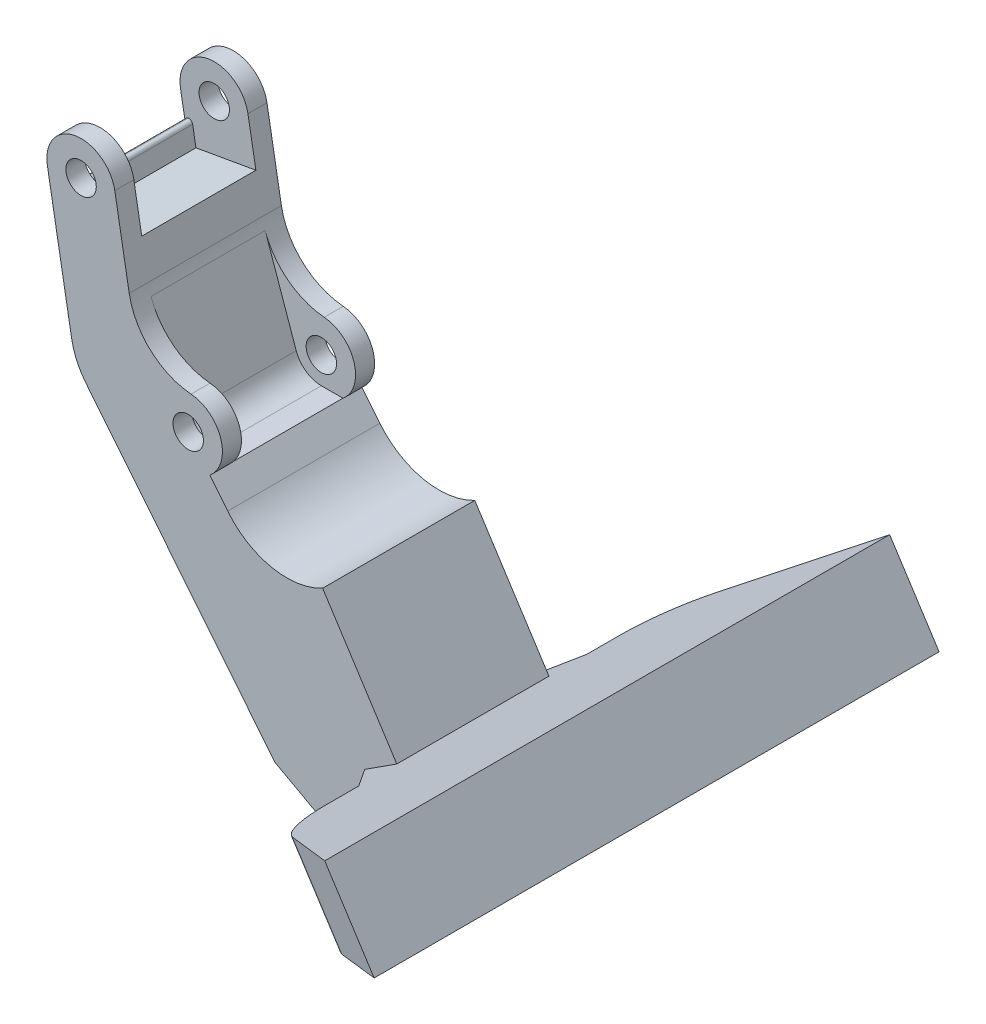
ISO-10303-21;
HEADER;
FILE_DESCRIPTION(('STEP AP214'),'2;1');
FILE_NAME('part.step','',(''),(''),'','','');
FILE_SCHEMA(('AUTOMOTIVE_DESIGN { 1 0 10303 214 1 1 1 1 }'));
ENDSEC;
DATA;
#1=APPLICATION_CONTEXT('core data for automotive mechanical design processes');
#2=APPLICATION_PROTOCOL_DEFINITION('international standard','automotive_design',2000,#1);
#3=PRODUCT_CONTEXT('',#1,'mechanical');
#4=PRODUCT('Part','Part','',(#3));
#5=PRODUCT_RELATED_PRODUCT_CATEGORY('part','',(#4));
#6=PRODUCT_DEFINITION_FORMATION('','',#4);
#7=PRODUCT_DEFINITION_CONTEXT('part definition',#1,'design');
#8=PRODUCT_DEFINITION('design','',#6,#7);
#9=PRODUCT_DEFINITION_SHAPE('','',#8);
#10=(LENGTH_UNIT() NAMED_UNIT(*) SI_UNIT(.MILLI.,.METRE.));
#11=(NAMED_UNIT(*) PLANE_ANGLE_UNIT() SI_UNIT($,.RADIAN.));
#12=(NAMED_UNIT(*) SI_UNIT($,.STERADIAN.) SOLID_ANGLE_UNIT());
#13=UNCERTAINTY_MEASURE_WITH_UNIT(LENGTH_MEASURE(1.E-05),#10,'distance_accuracy_value','');
#14=(GEOMETRIC_REPRESENTATION_CONTEXT(3) GLOBAL_UNCERTAINTY_ASSIGNED_CONTEXT((#13)) GLOBAL_UNIT_ASSIGNED_CONTEXT((#10,
#11,#12)) REPRESENTATION_CONTEXT('',''));
#15=CARTESIAN_POINT('',(0.,0.,0.));
#16=DIRECTION('',(0.,0.,1.));
#17=DIRECTION('',(1.,0.,0.));
#18=AXIS2_PLACEMENT_3D('',#15,#16,#17);
#19=CARTESIAN_POINT('',(-0.078322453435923,26.3586558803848,10.));
#20=DIRECTION('',(0.,0.,-1.));
#21=DIRECTION('',(-1.,0.,0.));
#22=AXIS2_PLACEMENT_3D('',#19,#20,#21);
#23=CYLINDRICAL_SURFACE('',#22,4.5);
#24=DIRECTION('',(0.,0.,-1.));
#25=VECTOR('',#24,1.);
#26=CARTESIAN_POINT('',(-4.50995734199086,25.5772390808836,10.));
#27=LINE('',#26,#25);
#28=CARTESIAN_POINT('',(-4.50995734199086,25.5772390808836,-7.5));
#29=VERTEX_POINT('',#28);
#30=CARTESIAN_POINT('',(-4.50995734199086,25.5772390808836,-10.));
#31=VERTEX_POINT('',#30);
#32=EDGE_CURVE('E284',#29,#31,#27,.T.);
#33=ORIENTED_EDGE('',*,*,#32,.F.);
#34=CARTESIAN_POINT('',(-0.078322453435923,26.3586558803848,-7.5));
#35=DIRECTION('',(0.,0.,1.));
#36=DIRECTION('',(1.,0.,0.));
#37=AXIS2_PLACEMENT_3D('',#34,#35,#36);
#38=CIRCLE('',#37,4.5);
#39=CARTESIAN_POINT('',(4.35331243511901,27.140072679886,-7.5));
#40=VERTEX_POINT('',#39);
#41=EDGE_CURVE('E391',#40,#29,#38,.T.);
#42=ORIENTED_EDGE('',*,*,#41,.F.);
#43=DIRECTION('',(0.,0.,-1.));
#44=VECTOR('',#43,1.);
#45=CARTESIAN_POINT('',(4.35331243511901,27.140072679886,10.));
#46=LINE('',#45,#44);
#47=CARTESIAN_POINT('',(4.35331243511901,27.140072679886,-10.));
#48=VERTEX_POINT('',#47);
#49=EDGE_CURVE('E283',#40,#48,#46,.T.);
#50=ORIENTED_EDGE('',*,*,#49,.T.);
#51=CARTESIAN_POINT('',(-0.078322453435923,26.3586558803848,-10.));
#52=DIRECTION('',(0.,0.,1.));
#53=DIRECTION('',(1.,0.,0.));
#54=AXIS2_PLACEMENT_3D('',#51,#52,#53);
#55=CIRCLE('',#54,4.5);
#56=EDGE_CURVE('E289',#48,#31,#55,.T.);
#57=ORIENTED_EDGE('',*,*,#56,.T.);
#58=EDGE_LOOP('',(#33,#42,#50,#57));
#59=FACE_BOUND('',#58,.T.);
#60=ADVANCED_FACE('F34',(#59),#23,.T.);
#61=CARTESIAN_POINT('',(20.3509788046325,13.1072854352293,-10.));
#62=DIRECTION('',(-0.840717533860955,-0.541473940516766,0.));
#63=DIRECTION('',(0.541473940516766,-0.840717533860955,0.));
#64=AXIS2_PLACEMENT_3D('',#61,#62,#63);
#65=PLANE('',#64);
#66=DIRECTION('',(0.,0.,1.));
#67=VECTOR('',#66,1.);
#68=CARTESIAN_POINT('',(41.4121930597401,-19.5933318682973,-25.));
#69=LINE('',#68,#67);
#70=CARTESIAN_POINT('',(41.4121930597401,-19.5933318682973,-10.));
#71=VERTEX_POINT('',#70);
#72=CARTESIAN_POINT('',(41.4121930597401,-19.5933318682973,10.));
#73=VERTEX_POINT('',#72);
#74=EDGE_CURVE('E311',#71,#73,#69,.T.);
#75=ORIENTED_EDGE('',*,*,#74,.F.);
#76=DIRECTION('',(0.541473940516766,-0.840717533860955,0.));
#77=VECTOR('',#76,1.);
#78=CARTESIAN_POINT('',(20.3509788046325,13.1072854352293,-10.));
#79=LINE('',#78,#77);
#80=CARTESIAN_POINT('',(31.6656621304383,-4.46041625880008,-10.));
#81=VERTEX_POINT('',#80);
#82=EDGE_CURVE('E529',#81,#71,#79,.T.);
#83=ORIENTED_EDGE('',*,*,#82,.F.);
#84=DIRECTION('',(0.,0.,1.));
#85=VECTOR('',#84,1.);
#86=CARTESIAN_POINT('',(31.6656621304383,-4.46041625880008,-10.));
#87=LINE('',#86,#85);
#88=CARTESIAN_POINT('',(31.6656621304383,-4.46041625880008,10.));
#89=VERTEX_POINT('',#88);
#90=EDGE_CURVE('E523',#81,#89,#87,.T.);
#91=ORIENTED_EDGE('',*,*,#90,.T.);
#92=DIRECTION('',(0.541473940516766,-0.840717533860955,0.));
#93=VECTOR('',#92,1.);
#94=CARTESIAN_POINT('',(20.3509788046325,13.1072854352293,10.));
#95=LINE('',#94,#93);
#96=EDGE_CURVE('E531',#89,#73,#95,.T.);
#97=ORIENTED_EDGE('',*,*,#96,.T.);
#98=EDGE_LOOP('',(#75,#83,#91,#97));
#99=FACE_BOUND('',#98,.T.);
#100=ADVANCED_FACE('F624',(#99),#65,.F.);
#101=CARTESIAN_POINT('',(16.8284271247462,0.999999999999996,10.));
#102=DIRECTION('',(-0.777777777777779,-0.628539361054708,0.));
#103=DIRECTION('',(0.628539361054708,-0.777777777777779,0.));
#104=AXIS2_PLACEMENT_3D('',#101,#102,#103);
#105=PLANE('',#104);
#106=DIRECTION('',(-0.628539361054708,0.777777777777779,0.));
#107=VECTOR('',#106,1.);
#108=CARTESIAN_POINT('',(16.8284271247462,0.999999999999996,10.));
#109=LINE('',#108,#107);
#110=CARTESIAN_POINT('',(19.1875828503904,-1.91930627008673,10.));
#111=VERTEX_POINT('',#110);
#112=CARTESIAN_POINT('',(16.8284271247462,0.999999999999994,10.));
#113=VERTEX_POINT('',#112);
#114=EDGE_CURVE('E443',#111,#113,#109,.T.);
#115=ORIENTED_EDGE('',*,*,#114,.F.);
#116=DIRECTION('',(0.,0.,-1.));
#117=VECTOR('',#116,1.);
#118=CARTESIAN_POINT('',(19.1875828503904,-1.91930627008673,10.));
#119=LINE('',#118,#117);
#120=CARTESIAN_POINT('',(19.1875828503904,-1.91930627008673,-10.));
#121=VERTEX_POINT('',#120);
#122=EDGE_CURVE('E312',#111,#121,#119,.T.);
#123=ORIENTED_EDGE('',*,*,#122,.T.);
#124=DIRECTION('',(-0.628539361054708,0.777777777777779,0.));
#125=VECTOR('',#124,1.);
#126=CARTESIAN_POINT('',(16.8284271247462,0.999999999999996,-10.));
#127=LINE('',#126,#125);
#128=CARTESIAN_POINT('',(16.8284271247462,0.999999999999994,-10.));
#129=VERTEX_POINT('',#128);
#130=EDGE_CURVE('E451',#121,#129,#127,.T.);
#131=ORIENTED_EDGE('',*,*,#130,.T.);
#132=DIRECTION('',(0.,0.,-1.));
#133=VECTOR('',#132,1.);
#134=CARTESIAN_POINT('',(16.8284271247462,0.999999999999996,10.));
#135=LINE('',#134,#133);
#136=CARTESIAN_POINT('',(16.8284271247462,0.999999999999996,-7.5));
#137=VERTEX_POINT('',#136);
#138=EDGE_CURVE('E439',#137,#129,#135,.T.);
#139=ORIENTED_EDGE('',*,*,#138,.F.);
#140=DIRECTION('',(0.,0.,1.));
#141=VECTOR('',#140,1.);
#142=CARTESIAN_POINT('',(16.8284271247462,0.999999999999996,-7.5));
#143=LINE('',#142,#141);
#144=CARTESIAN_POINT('',(16.8284271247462,0.999999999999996,7.5));
#145=VERTEX_POINT('',#144);
#146=EDGE_CURVE('E489',#137,#145,#143,.T.);
#147=ORIENTED_EDGE('',*,*,#146,.T.);
#148=EDGE_CURVE('E442',#113,#145,#135,.T.);
#149=ORIENTED_EDGE('',*,*,#148,.F.);
#150=EDGE_LOOP('',(#115,#123,#131,#139,#147,#149));
#151=FACE_BOUND('',#150,.T.);
#152=ADVANCED_FACE('F608',(#151),#105,.F.);
#153=CARTESIAN_POINT('',(14.,4.5,10.));
#154=DIRECTION('',(0.,0.,-1.));
#155=DIRECTION('',(-1.,0.,0.));
#156=AXIS2_PLACEMENT_3D('',#153,#154,#155);
#157=CYLINDRICAL_SURFACE('',#156,4.5);
#158=ORIENTED_EDGE('',*,*,#138,.T.);
#159=CARTESIAN_POINT('',(14.,4.5,-10.));
#160=DIRECTION('',(0.,0.,1.));
#161=DIRECTION('',(1.,0.,0.));
#162=AXIS2_PLACEMENT_3D('',#159,#160,#161);
#163=CIRCLE('',#162,4.5);
#164=CARTESIAN_POINT('',(14.3706269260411,8.98471132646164,-10.));
#165=VERTEX_POINT('',#164);
#166=EDGE_CURVE('E414',#129,#165,#163,.T.);
#167=ORIENTED_EDGE('',*,*,#166,.T.);
#168=DIRECTION('',(0.,0.,-1.));
#169=VECTOR('',#168,1.);
#170=CARTESIAN_POINT('',(14.3706269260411,8.98471132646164,10.));
#171=LINE('',#170,#169);
#172=CARTESIAN_POINT('',(14.3706269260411,8.98471132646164,-7.5));
#173=VERTEX_POINT('',#172);
#174=EDGE_CURVE('E296',#165,#173,#171,.F.);
#175=ORIENTED_EDGE('',*,*,#174,.T.);
#176=CARTESIAN_POINT('',(14.,4.5,-7.5));
#177=DIRECTION('',(0.,0.,1.));
#178=DIRECTION('',(1.,0.,0.));
#179=AXIS2_PLACEMENT_3D('',#176,#177,#178);
#180=CIRCLE('',#179,4.5);
#181=EDGE_CURVE('E437',#137,#173,#180,.T.);
#182=ORIENTED_EDGE('',*,*,#181,.F.);
#183=EDGE_LOOP('',(#158,#167,#175,#182));
#184=FACE_BOUND('',#183,.T.);
#185=ADVANCED_FACE('F436',(#184),#157,.T.);
#186=ORIENTED_EDGE('',*,*,#148,.T.);
#187=CARTESIAN_POINT('',(14.,4.5,7.5));
#188=DIRECTION('',(0.,0.,1.));
#189=DIRECTION('',(1.,0.,0.));
#190=AXIS2_PLACEMENT_3D('',#187,#188,#189);
#191=CIRCLE('',#190,4.5);
#192=CARTESIAN_POINT('',(14.3706269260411,8.98471132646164,7.5));
#193=VERTEX_POINT('',#192);
#194=EDGE_CURVE('E475',#145,#193,#191,.T.);
#195=ORIENTED_EDGE('',*,*,#194,.T.);
#196=CARTESIAN_POINT('',(14.3706269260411,8.98471132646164,10.));
#197=VERTEX_POINT('',#196);
#198=EDGE_CURVE('E295',#193,#197,#171,.F.);
#199=ORIENTED_EDGE('',*,*,#198,.T.);
#200=CARTESIAN_POINT('',(14.,4.5,10.));
#201=DIRECTION('',(0.,0.,1.));
#202=DIRECTION('',(1.,0.,0.));
#203=AXIS2_PLACEMENT_3D('',#200,#201,#202);
#204=CIRCLE('',#203,4.5);
#205=EDGE_CURVE('E504',#113,#197,#204,.T.);
#206=ORIENTED_EDGE('',*,*,#205,.F.);
#207=EDGE_LOOP('',(#186,#195,#199,#206));
#208=FACE_BOUND('',#207,.T.);
#209=ADVANCED_FACE('F612',(#208),#157,.T.);
#210=CARTESIAN_POINT('',(7.55189668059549,9.,10.));
#211=DIRECTION('',(0.,0.,-1.));
#212=DIRECTION('',(-1.,0.,0.));
#213=AXIS2_PLACEMENT_3D('',#210,#211,#212);
#214=CYLINDRICAL_SURFACE('',#213,9.);
#215=CARTESIAN_POINT('',(7.55189668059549,9.,-10.));
#216=DIRECTION('',(0.,0.,1.));
#217=DIRECTION('',(1.,0.,0.));
#218=AXIS2_PLACEMENT_3D('',#215,#216,#217);
#219=CIRCLE('',#218,9.);
#220=CARTESIAN_POINT('',(0.551896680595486,3.34314575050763,-10.));
#221=VERTEX_POINT('',#220);
#222=CARTESIAN_POINT('',(-1.31137309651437,7.43716640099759,-10.));
#223=VERTEX_POINT('',#222);
#224=EDGE_CURVE('E299',#221,#223,#219,.F.);
#225=ORIENTED_EDGE('',*,*,#224,.F.);
#226=DIRECTION('',(0.,0.,-1.));
#227=VECTOR('',#226,1.);
#228=CARTESIAN_POINT('',(0.551896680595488,3.34314575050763,10.));
#229=LINE('',#228,#227);
#230=CARTESIAN_POINT('',(0.551896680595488,3.34314575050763,10.));
#231=VERTEX_POINT('',#230);
#232=EDGE_CURVE('E454',#231,#221,#229,.T.);
#233=ORIENTED_EDGE('',*,*,#232,.F.);
#234=CARTESIAN_POINT('',(7.55189668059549,9.,10.));
#235=DIRECTION('',(0.,0.,1.));
#236=DIRECTION('',(1.,0.,0.));
#237=AXIS2_PLACEMENT_3D('',#234,#235,#236);
#238=CIRCLE('',#237,9.);
#239=CARTESIAN_POINT('',(-1.31137309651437,7.43716640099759,10.));
#240=VERTEX_POINT('',#239);
#241=EDGE_CURVE('E303',#240,#231,#238,.T.);
#242=ORIENTED_EDGE('',*,*,#241,.F.);
#243=DIRECTION('',(0.,0.,-1.));
#244=VECTOR('',#243,1.);
#245=CARTESIAN_POINT('',(-1.31137309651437,7.43716640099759,10.));
#246=LINE('',#245,#244);
#247=EDGE_CURVE('E301',#223,#240,#246,.F.);
#248=ORIENTED_EDGE('',*,*,#247,.F.);
#249=EDGE_LOOP('',(#225,#233,#242,#248));
#250=FACE_BOUND('',#249,.T.);
#251=ADVANCED_FACE('F513',(#250),#214,.T.);
#252=CARTESIAN_POINT('',(15.1118807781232,17.9541339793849,10.));
#253=DIRECTION('',(0.,0.,-1.));
#254=DIRECTION('',(-1.,0.,0.));
#255=AXIS2_PLACEMENT_3D('',#252,#253,#254);
#256=CYLINDRICAL_SURFACE('',#255,9.);
#257=CARTESIAN_POINT('',(15.1118807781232,17.9541339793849,-7.5));
#258=DIRECTION('',(0.,0.,-1.));
#259=DIRECTION('',(1.,0.,0.));
#260=AXIS2_PLACEMENT_3D('',#257,#258,#259);
#261=CIRCLE('',#260,9.00000000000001);
#262=CARTESIAN_POINT('',(6.61859445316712,14.9768722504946,-7.5));
#263=VERTEX_POINT('',#262);
#264=EDGE_CURVE('E432',#173,#263,#261,.T.);
#265=ORIENTED_EDGE('',*,*,#264,.F.);
#266=ORIENTED_EDGE('',*,*,#174,.F.);
#267=CARTESIAN_POINT('',(15.1118807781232,17.9541339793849,-10.));
#268=DIRECTION('',(0.,0.,1.));
#269=DIRECTION('',(1.,0.,0.));
#270=AXIS2_PLACEMENT_3D('',#267,#268,#269);
#271=CIRCLE('',#270,9.);
#272=CARTESIAN_POINT('',(6.24861100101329,16.3913003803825,-10.));
#273=VERTEX_POINT('',#272);
#274=EDGE_CURVE('E306',#273,#165,#271,.T.);
#275=ORIENTED_EDGE('',*,*,#274,.F.);
#276=DIRECTION('',(0.,0.,1.));
#277=VECTOR('',#276,1.);
#278=CARTESIAN_POINT('',(6.24861100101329,16.3913003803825,-10.));
#279=LINE('',#278,#277);
#280=CARTESIAN_POINT('',(6.24861100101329,16.3913003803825,10.));
#281=VERTEX_POINT('',#280);
#282=EDGE_CURVE('E292',#281,#273,#279,.F.);
#283=ORIENTED_EDGE('',*,*,#282,.F.);
#284=CARTESIAN_POINT('',(15.1118807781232,17.9541339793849,10.));
#285=DIRECTION('',(0.,0.,1.));
#286=DIRECTION('',(1.,0.,0.));
#287=AXIS2_PLACEMENT_3D('',#284,#285,#286);
#288=CIRCLE('',#287,9.);
#289=EDGE_CURVE('E309',#197,#281,#288,.F.);
#290=ORIENTED_EDGE('',*,*,#289,.F.);
#291=ORIENTED_EDGE('',*,*,#198,.F.);
#292=CARTESIAN_POINT('',(15.1118807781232,17.9541339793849,7.5));
#293=DIRECTION('',(0.,0.,-1.));
#294=DIRECTION('',(1.,0.,0.));
#295=AXIS2_PLACEMENT_3D('',#292,#293,#294);
#296=CIRCLE('',#295,9.00000000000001);
#297=CARTESIAN_POINT('',(6.61859445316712,14.9768722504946,7.5));
#298=VERTEX_POINT('',#297);
#299=EDGE_CURVE('E478',#193,#298,#296,.T.);
#300=ORIENTED_EDGE('',*,*,#299,.T.);
#301=DIRECTION('',(0.,0.,1.));
#302=VECTOR('',#301,1.);
#303=CARTESIAN_POINT('',(6.61859445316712,14.9768722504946,-7.5));
#304=LINE('',#303,#302);
#305=EDGE_CURVE('E486',#263,#298,#304,.T.);
#306=ORIENTED_EDGE('',*,*,#305,.F.);
#307=EDGE_LOOP('',(#265,#266,#275,#283,#290,#291,#300,#306));
#308=FACE_BOUND('',#307,.T.);
#309=ADVANCED_FACE('F430',(#308),#256,.F.);
#310=CARTESIAN_POINT('',(7.55189668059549,9.,10.));
#311=DIRECTION('',(-0.984807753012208,-0.173648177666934,0.));
#312=DIRECTION('',(0.173648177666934,-0.984807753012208,0.));
#313=AXIS2_PLACEMENT_3D('',#310,#311,#312);
#314=PLANE('',#313);
#315=DIRECTION('',(-0.173648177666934,0.984807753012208,0.));
#316=VECTOR('',#315,1.);
#317=CARTESIAN_POINT('',(5.39520150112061,21.2312261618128,-7.5));
#318=LINE('',#317,#316);
#319=CARTESIAN_POINT('',(5.39520150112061,21.2312261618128,-7.5));
#320=VERTEX_POINT('',#319);
#321=EDGE_CURVE('E494',#320,#40,#318,.T.);
#322=ORIENTED_EDGE('',*,*,#321,.F.);
#323=DIRECTION('',(0.,0.,1.));
#324=VECTOR('',#323,1.);
#325=CARTESIAN_POINT('',(5.39520150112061,21.2312261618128,-7.5));
#326=LINE('',#325,#324);
#327=CARTESIAN_POINT('',(5.39520150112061,21.2312261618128,7.5));
#328=VERTEX_POINT('',#327);
#329=EDGE_CURVE('E390',#320,#328,#326,.T.);
#330=ORIENTED_EDGE('',*,*,#329,.T.);
#331=DIRECTION('',(-0.173648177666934,0.984807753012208,0.));
#332=VECTOR('',#331,1.);
#333=CARTESIAN_POINT('',(5.39520150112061,21.2312261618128,7.5));
#334=LINE('',#333,#332);
#335=CARTESIAN_POINT('',(4.35331243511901,27.140072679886,7.5));
#336=VERTEX_POINT('',#335);
#337=EDGE_CURVE('E267',#328,#336,#334,.T.);
#338=ORIENTED_EDGE('',*,*,#337,.T.);
#339=CARTESIAN_POINT('',(4.35331243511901,27.140072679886,10.));
#340=VERTEX_POINT('',#339);
#341=EDGE_CURVE('E264',#340,#336,#46,.T.);
#342=ORIENTED_EDGE('',*,*,#341,.F.);
#343=DIRECTION('',(-0.173648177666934,0.984807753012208,0.));
#344=VECTOR('',#343,1.);
#345=CARTESIAN_POINT('',(7.55189668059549,9.,10.));
#346=LINE('',#345,#344);
#347=EDGE_CURVE('E505',#281,#340,#346,.T.);
#348=ORIENTED_EDGE('',*,*,#347,.F.);
#349=ORIENTED_EDGE('',*,*,#282,.T.);
#350=DIRECTION('',(-0.173648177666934,0.984807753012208,0.));
#351=VECTOR('',#350,1.);
#352=CARTESIAN_POINT('',(7.55189668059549,9.,-10.));
#353=LINE('',#352,#351);
#354=EDGE_CURVE('E409',#273,#48,#353,.T.);
#355=ORIENTED_EDGE('',*,*,#354,.T.);
#356=ORIENTED_EDGE('',*,*,#49,.F.);
#357=EDGE_LOOP('',(#322,#330,#338,#342,#348,#349,#355,#356));
#358=FACE_BOUND('',#357,.T.);
#359=ADVANCED_FACE('F422',(#358),#314,.F.);
#360=CARTESIAN_POINT('',(-0.078322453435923,26.3586558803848,7.5));
#361=DIRECTION('',(0.,0.,1.));
#362=DIRECTION('',(1.,0.,0.));
#363=AXIS2_PLACEMENT_3D('',#360,#361,#362);
#364=CIRCLE('',#363,4.5);
#365=CARTESIAN_POINT('',(-4.50995734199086,25.5772390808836,7.5));
#366=VERTEX_POINT('',#365);
#367=EDGE_CURVE('E256',#336,#366,#364,.T.);
#368=ORIENTED_EDGE('',*,*,#367,.T.);
#369=CARTESIAN_POINT('',(-4.50995734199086,25.5772390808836,10.));
#370=VERTEX_POINT('',#369);
#371=EDGE_CURVE('E261',#370,#366,#27,.T.);
#372=ORIENTED_EDGE('',*,*,#371,.F.);
#373=CARTESIAN_POINT('',(-0.078322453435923,26.3586558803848,10.));
#374=DIRECTION('',(0.,0.,1.));
#375=DIRECTION('',(1.,0.,0.));
#376=AXIS2_PLACEMENT_3D('',#373,#374,#375);
#377=CIRCLE('',#376,4.5);
#378=EDGE_CURVE('E287',#340,#370,#377,.T.);
#379=ORIENTED_EDGE('',*,*,#378,.F.);
#380=ORIENTED_EDGE('',*,*,#341,.T.);
#381=EDGE_LOOP('',(#368,#372,#379,#380));
#382=FACE_BOUND('',#381,.T.);
#383=ADVANCED_FACE('F258',(#382),#23,.T.);
#384=CARTESIAN_POINT('',(0.,0.,10.));
#385=DIRECTION('',(0.984807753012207,0.173648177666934,0.));
#386=DIRECTION('',(-0.173648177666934,0.984807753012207,0.));
#387=AXIS2_PLACEMENT_3D('',#384,#385,#386);
#388=PLANE('',#387);
#389=DIRECTION('',(0.,0.,-1.));
#390=VECTOR('',#389,1.);
#391=CARTESIAN_POINT('',(-3.90218872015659,22.1304119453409,10.));
#392=LINE('',#391,#390);
#393=CARTESIAN_POINT('',(-3.90218872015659,22.1304119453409,7.5));
#394=VERTEX_POINT('',#393);
#395=CARTESIAN_POINT('',(-3.90218872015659,22.1304119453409,-7.5));
#396=VERTEX_POINT('',#395);
#397=EDGE_CURVE('E362',#394,#396,#392,.T.);
#398=ORIENTED_EDGE('',*,*,#397,.T.);
#399=DIRECTION('',(-0.173648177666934,0.984807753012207,0.));
#400=VECTOR('',#399,1.);
#401=CARTESIAN_POINT('',(0.,0.,-7.5));
#402=LINE('',#401,#400);
#403=EDGE_CURVE('E277',#396,#29,#402,.T.);
#404=ORIENTED_EDGE('',*,*,#403,.T.);
#405=ORIENTED_EDGE('',*,*,#32,.T.);
#406=DIRECTION('',(0.173648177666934,-0.984807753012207,0.));
#407=VECTOR('',#406,1.);
#408=CARTESIAN_POINT('',(0.,0.,-10.));
#409=LINE('',#408,#407);
#410=EDGE_CURVE('E410',#31,#223,#409,.T.);
#411=ORIENTED_EDGE('',*,*,#410,.T.);
#412=ORIENTED_EDGE('',*,*,#247,.T.);
#413=DIRECTION('',(0.173648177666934,-0.984807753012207,0.));
#414=VECTOR('',#413,1.);
#415=CARTESIAN_POINT('',(0.,0.,10.));
#416=LINE('',#415,#414);
#417=EDGE_CURVE('E282',#370,#240,#416,.T.);
#418=ORIENTED_EDGE('',*,*,#417,.F.);
#419=ORIENTED_EDGE('',*,*,#371,.T.);
#420=DIRECTION('',(0.173648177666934,-0.984807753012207,0.));
#421=VECTOR('',#420,1.);
#422=CARTESIAN_POINT('',(0.,0.,7.5));
#423=LINE('',#422,#421);
#424=EDGE_CURVE('E269',#366,#394,#423,.T.);
#425=ORIENTED_EDGE('',*,*,#424,.T.);
#426=EDGE_LOOP('',(#398,#404,#405,#411,#412,#418,#419,#425));
#427=FACE_BOUND('',#426,.T.);
#428=ADVANCED_FACE('F280',(#427),#388,.F.);
#429=CARTESIAN_POINT('',(-0.078322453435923,26.3586558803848,10.));
#430=DIRECTION('',(0.,0.,1.));
#431=DIRECTION('',(1.,0.,0.));
#432=AXIS2_PLACEMENT_3D('',#429,#430,#431);
#433=PLANE('',#432);
#434=CARTESIAN_POINT('',(14.,4.5,10.));
#435=DIRECTION('',(0.,0.,1.));
#436=DIRECTION('',(1.,0.,0.));
#437=AXIS2_PLACEMENT_3D('',#434,#435,#436);
#438=CIRCLE('',#437,2.);
#439=CARTESIAN_POINT('',(16.,4.5,10.));
#440=VERTEX_POINT('',#439);
#441=EDGE_CURVE('E579',#440,#440,#438,.T.);
#442=ORIENTED_EDGE('',*,*,#441,.F.);
#443=EDGE_LOOP('',(#442));
#444=FACE_BOUND('',#443,.T.);
#445=CARTESIAN_POINT('',(-0.078322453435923,26.3586558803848,10.));
#446=DIRECTION('',(0.,0.,1.));
#447=DIRECTION('',(1.,0.,0.));
#448=AXIS2_PLACEMENT_3D('',#445,#446,#447);
#449=CIRCLE('',#448,2.);
#450=CARTESIAN_POINT('',(1.92167754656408,26.3586558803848,10.));
#451=VERTEX_POINT('',#450);
#452=EDGE_CURVE('E367',#451,#451,#449,.T.);
#453=ORIENTED_EDGE('',*,*,#452,.F.);
#454=EDGE_LOOP('',(#453));
#455=FACE_BOUND('',#454,.T.);
#456=DIRECTION('',(0.840717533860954,0.541473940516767,0.));
#457=VECTOR('',#456,1.);
#458=CARTESIAN_POINT('',(27.5589015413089,-42.789227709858,10.));
#459=LINE('',#458,#457);
#460=CARTESIAN_POINT('',(39.5027050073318,-35.0966816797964,10.));
#461=VERTEX_POINT('',#460);
#462=CARTESIAN_POINT('',(43.7062926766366,-32.3893119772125,10.));
#463=VERTEX_POINT('',#462);
#464=EDGE_CURVE('E534',#461,#463,#459,.T.);
#465=ORIENTED_EDGE('',*,*,#464,.T.);
#466=DIRECTION('',(-0.541473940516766,0.840717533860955,0.));
#467=VECTOR('',#466,1.);
#468=CARTESIAN_POINT('',(37.2086053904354,-22.3007015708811,10.));
#469=LINE('',#468,#467);
#470=CARTESIAN_POINT('',(37.2086053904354,-22.3007015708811,10.));
#471=VERTEX_POINT('',#470);
#472=EDGE_CURVE('E351',#463,#471,#469,.T.);
#473=ORIENTED_EDGE('',*,*,#472,.T.);
#474=DIRECTION('',(0.840717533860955,0.541473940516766,0.));
#475=VECTOR('',#474,1.);
#476=CARTESIAN_POINT('',(33.0050177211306,-25.0080712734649,10.));
#477=LINE('',#476,#475);
#478=EDGE_CURVE('E349',#471,#73,#477,.T.);
#479=ORIENTED_EDGE('',*,*,#478,.T.);
#480=ORIENTED_EDGE('',*,*,#96,.F.);
#481=CARTESIAN_POINT('',(26.9653606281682,4.36608734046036,10.));
#482=DIRECTION('',(0.,0.,1.));
#483=DIRECTION('',(1.,0.,0.));
#484=AXIS2_PLACEMENT_3D('',#481,#482,#483);
#485=CIRCLE('',#484,10.);
#486=EDGE_CURVE('E334',#89,#111,#485,.F.);
#487=ORIENTED_EDGE('',*,*,#486,.T.);
#488=ORIENTED_EDGE('',*,*,#114,.T.);
#489=ORIENTED_EDGE('',*,*,#205,.T.);
#490=ORIENTED_EDGE('',*,*,#289,.T.);
#491=ORIENTED_EDGE('',*,*,#347,.T.);
#492=ORIENTED_EDGE('',*,*,#378,.T.);
#493=ORIENTED_EDGE('',*,*,#417,.T.);
#494=ORIENTED_EDGE('',*,*,#241,.T.);
#495=DIRECTION('',(0.628539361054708,-0.777777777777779,0.));
#496=VECTOR('',#495,1.);
#497=CARTESIAN_POINT('',(0.551896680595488,3.34314575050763,10.));
#498=LINE('',#497,#496);
#499=CARTESIAN_POINT('',(25.4124428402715,-27.4202106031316,10.));
#500=VERTEX_POINT('',#499);
#501=EDGE_CURVE('E447',#231,#500,#498,.T.);
#502=ORIENTED_EDGE('',*,*,#501,.T.);
#503=DIRECTION('',(0.878134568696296,-0.478413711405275,0.));
#504=VECTOR('',#503,1.);
#505=CARTESIAN_POINT('',(-5.70315727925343,-10.4682191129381,10.));
#506=LINE('',#505,#504);
#507=EDGE_CURVE('E536',#500,#461,#506,.T.);
#508=ORIENTED_EDGE('',*,*,#507,.T.);
#509=EDGE_LOOP('',(#465,#473,#479,#480,#487,#488,#489,#490,#491,#492,#493,#494,#502,#508));
#510=FACE_BOUND('',#509,.T.);
#511=ADVANCED_FACE('F508',(#444,#455,#510),#433,.T.);
#512=CARTESIAN_POINT('',(-0.078322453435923,26.3586558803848,-10.));
#513=DIRECTION('',(0.,0.,1.));
#514=DIRECTION('',(1.,0.,0.));
#515=AXIS2_PLACEMENT_3D('',#512,#513,#514);
#516=PLANE('',#515);
#517=CARTESIAN_POINT('',(14.,4.5,-10.));
#518=DIRECTION('',(0.,0.,1.));
#519=DIRECTION('',(1.,0.,0.));
#520=AXIS2_PLACEMENT_3D('',#517,#518,#519);
#521=CIRCLE('',#520,2.);
#522=CARTESIAN_POINT('',(16.,4.5,-10.));
#523=VERTEX_POINT('',#522);
#524=EDGE_CURVE('E582',#523,#523,#521,.T.);
#525=ORIENTED_EDGE('',*,*,#524,.T.);
#526=EDGE_LOOP('',(#525));
#527=FACE_BOUND('',#526,.T.);
#528=CARTESIAN_POINT('',(-0.078322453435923,26.3586558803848,-10.));
#529=DIRECTION('',(0.,0.,1.));
#530=DIRECTION('',(1.,0.,0.));
#531=AXIS2_PLACEMENT_3D('',#528,#529,#530);
#532=CIRCLE('',#531,2.);
#533=CARTESIAN_POINT('',(1.92167754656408,26.3586558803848,-10.));
#534=VERTEX_POINT('',#533);
#535=EDGE_CURVE('E278',#534,#534,#532,.T.);
#536=ORIENTED_EDGE('',*,*,#535,.T.);
#537=EDGE_LOOP('',(#536));
#538=FACE_BOUND('',#537,.T.);
#539=DIRECTION('',(-0.840717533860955,-0.541473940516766,0.));
#540=VECTOR('',#539,1.);
#541=CARTESIAN_POINT('',(59.0672612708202,-8.22237911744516,-10.));
#542=LINE('',#541,#540);
#543=CARTESIAN_POINT('',(37.2086053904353,-22.3007015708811,-10.));
#544=VERTEX_POINT('',#543);
#545=EDGE_CURVE('E338',#71,#544,#542,.T.);
#546=ORIENTED_EDGE('',*,*,#545,.T.);
#547=DIRECTION('',(0.541473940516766,-0.840717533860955,0.));
#548=VECTOR('',#547,1.);
#549=CARTESIAN_POINT('',(4.12526521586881,29.0660255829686,-10.));
#550=LINE('',#549,#548);
#551=CARTESIAN_POINT('',(43.7062926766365,-32.3893119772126,-10.));
#552=VERTEX_POINT('',#551);
#553=EDGE_CURVE('E341',#544,#552,#550,.T.);
#554=ORIENTED_EDGE('',*,*,#553,.T.);
#555=DIRECTION('',(0.840717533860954,0.541473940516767,0.));
#556=VECTOR('',#555,1.);
#557=CARTESIAN_POINT('',(27.5589015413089,-42.789227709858,-10.));
#558=LINE('',#557,#556);
#559=CARTESIAN_POINT('',(39.5027050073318,-35.0966816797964,-10.));
#560=VERTEX_POINT('',#559);
#561=EDGE_CURVE('E542',#560,#552,#558,.T.);
#562=ORIENTED_EDGE('',*,*,#561,.F.);
#563=DIRECTION('',(0.878134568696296,-0.478413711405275,0.));
#564=VECTOR('',#563,1.);
#565=CARTESIAN_POINT('',(-5.70315727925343,-10.4682191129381,-10.));
#566=LINE('',#565,#564);
#567=CARTESIAN_POINT('',(25.4124428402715,-27.4202106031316,-10.));
#568=VERTEX_POINT('',#567);
#569=EDGE_CURVE('E522',#568,#560,#566,.T.);
#570=ORIENTED_EDGE('',*,*,#569,.F.);
#571=DIRECTION('',(0.628539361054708,-0.777777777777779,0.));
#572=VECTOR('',#571,1.);
#573=CARTESIAN_POINT('',(0.551896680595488,3.34314575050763,-10.));
#574=LINE('',#573,#572);
#575=EDGE_CURVE('E518',#221,#568,#574,.T.);
#576=ORIENTED_EDGE('',*,*,#575,.F.);
#577=ORIENTED_EDGE('',*,*,#224,.T.);
#578=ORIENTED_EDGE('',*,*,#410,.F.);
#579=ORIENTED_EDGE('',*,*,#56,.F.);
#580=ORIENTED_EDGE('',*,*,#354,.F.);
#581=ORIENTED_EDGE('',*,*,#274,.T.);
#582=ORIENTED_EDGE('',*,*,#166,.F.);
#583=ORIENTED_EDGE('',*,*,#130,.F.);
#584=CARTESIAN_POINT('',(26.9653606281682,4.36608734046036,-10.));
#585=DIRECTION('',(0.,0.,1.));
#586=DIRECTION('',(1.,0.,0.));
#587=AXIS2_PLACEMENT_3D('',#584,#585,#586);
#588=CIRCLE('',#587,10.);
#589=EDGE_CURVE('E336',#121,#81,#588,.T.);
#590=ORIENTED_EDGE('',*,*,#589,.T.);
#591=ORIENTED_EDGE('',*,*,#82,.T.);
#592=EDGE_LOOP('',(#546,#554,#562,#570,#576,#577,#578,#579,#580,#581,#582,#583,#590,#591));
#593=FACE_BOUND('',#592,.T.);
#594=ADVANCED_FACE('F411',(#527,#538,#593),#516,.F.);
#595=CARTESIAN_POINT('',(-2.48326052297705,19.8420407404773,-7.5));
#596=DIRECTION('',(0.173648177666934,-0.984807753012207,0.));
#597=DIRECTION('',(0.984807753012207,0.173648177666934,0.));
#598=AXIS2_PLACEMENT_3D('',#595,#596,#597);
#599=PLANE('',#598);
#600=DIRECTION('',(0.984807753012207,0.173648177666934,0.));
#601=VECTOR('',#600,1.);
#602=CARTESIAN_POINT('',(-2.48326052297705,19.8420407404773,7.5));
#603=LINE('',#602,#601);
#604=CARTESIAN_POINT('',(-2.48326052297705,19.8420407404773,7.5));
#605=VERTEX_POINT('',#604);
#606=EDGE_CURVE('E485',#605,#328,#603,.T.);
#607=ORIENTED_EDGE('',*,*,#606,.T.);
#608=ORIENTED_EDGE('',*,*,#329,.F.);
#609=DIRECTION('',(0.984807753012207,0.173648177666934,0.));
#610=VECTOR('',#609,1.);
#611=CARTESIAN_POINT('',(-2.48326052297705,19.8420407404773,-7.5));
#612=LINE('',#611,#610);
#613=CARTESIAN_POINT('',(-2.48326052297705,19.8420407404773,-7.5));
#614=VERTEX_POINT('',#613);
#615=EDGE_CURVE('E492',#614,#320,#612,.T.);
#616=ORIENTED_EDGE('',*,*,#615,.F.);
#617=DIRECTION('',(0.,0.,1.));
#618=VECTOR('',#617,1.);
#619=CARTESIAN_POINT('',(-2.48326052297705,19.8420407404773,-7.5));
#620=LINE('',#619,#618);
#621=EDGE_CURVE('E388',#614,#605,#620,.T.);
#622=ORIENTED_EDGE('',*,*,#621,.T.);
#623=EDGE_LOOP('',(#607,#608,#616,#622));
#624=FACE_BOUND('',#623,.T.);
#625=ADVANCED_FACE('F812',(#624),#599,.F.);
#626=CARTESIAN_POINT('',(-4.01630080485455,28.5363442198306,-7.5));
#627=DIRECTION('',(-0.984807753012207,-0.173648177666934,0.));
#628=DIRECTION('',(0.173648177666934,-0.984807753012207,0.));
#629=AXIS2_PLACEMENT_3D('',#626,#627,#628);
#630=PLANE('',#629);
#631=DIRECTION('',(0.173648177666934,-0.984807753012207,0.));
#632=VECTOR('',#631,1.);
#633=CARTESIAN_POINT('',(-4.01630080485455,28.5363442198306,-7.5));
#634=LINE('',#633,#632);
#635=CARTESIAN_POINT('',(-2.91738096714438,22.3040601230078,-7.5));
#636=VERTEX_POINT('',#635);
#637=EDGE_CURVE('E380',#636,#614,#634,.T.);
#638=ORIENTED_EDGE('',*,*,#637,.F.);
#639=DIRECTION('',(0.,0.,-1.));
#640=VECTOR('',#639,1.);
#641=CARTESIAN_POINT('',(-2.91738096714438,22.3040601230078,-7.5));
#642=LINE('',#641,#640);
#643=CARTESIAN_POINT('',(-2.91738096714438,22.3040601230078,7.5));
#644=VERTEX_POINT('',#643);
#645=EDGE_CURVE('E373',#636,#644,#642,.F.);
#646=ORIENTED_EDGE('',*,*,#645,.T.);
#647=DIRECTION('',(0.173648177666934,-0.984807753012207,0.));
#648=VECTOR('',#647,1.);
#649=CARTESIAN_POINT('',(-4.01630080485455,28.5363442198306,7.5));
#650=LINE('',#649,#648);
#651=EDGE_CURVE('E266',#644,#605,#650,.T.);
#652=ORIENTED_EDGE('',*,*,#651,.T.);
#653=ORIENTED_EDGE('',*,*,#621,.F.);
#654=EDGE_LOOP('',(#638,#646,#652,#653));
#655=FACE_BOUND('',#654,.T.);
#656=ADVANCED_FACE('F386',(#655),#630,.F.);
#657=CARTESIAN_POINT('',(-0.078322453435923,26.3586558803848,-7.5));
#658=DIRECTION('',(0.,0.,1.));
#659=DIRECTION('',(1.,0.,0.));
#660=AXIS2_PLACEMENT_3D('',#657,#658,#659);
#661=PLANE('',#660);
#662=CARTESIAN_POINT('',(-0.078322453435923,26.3586558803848,-7.5));
#663=DIRECTION('',(0.,0.,1.));
#664=DIRECTION('',(1.,0.,0.));
#665=AXIS2_PLACEMENT_3D('',#662,#663,#664);
#666=CIRCLE('',#665,2.);
#667=CARTESIAN_POINT('',(1.92167754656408,26.3586558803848,-7.5));
#668=VERTEX_POINT('',#667);
#669=EDGE_CURVE('E366',#668,#668,#666,.T.);
#670=ORIENTED_EDGE('',*,*,#669,.F.);
#671=EDGE_LOOP('',(#670));
#672=FACE_BOUND('',#671,.T.);
#673=ORIENTED_EDGE('',*,*,#615,.T.);
#674=ORIENTED_EDGE('',*,*,#321,.T.);
#675=ORIENTED_EDGE('',*,*,#41,.T.);
#676=ORIENTED_EDGE('',*,*,#403,.F.);
#677=CARTESIAN_POINT('',(-3.40978484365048,22.2172360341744,-7.5));
#678=DIRECTION('',(0.,0.,1.));
#679=DIRECTION('',(1.,0.,0.));
#680=AXIS2_PLACEMENT_3D('',#677,#678,#679);
#681=CIRCLE('',#680,0.5);
#682=CARTESIAN_POINT('',(-3.49660893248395,22.7096399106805,-7.5));
#683=VERTEX_POINT('',#682);
#684=EDGE_CURVE('E56',#396,#683,#681,.F.);
#685=ORIENTED_EDGE('',*,*,#684,.T.);
#686=CARTESIAN_POINT('',(-3.40978484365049,22.2172360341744,-7.5));
#687=DIRECTION('',(0.,0.,1.));
#688=DIRECTION('',(1.,0.,0.));
#689=AXIS2_PLACEMENT_3D('',#686,#687,#688);
#690=CIRCLE('',#689,0.5);
#691=EDGE_CURVE('E43',#683,#636,#690,.F.);
#692=ORIENTED_EDGE('',*,*,#691,.T.);
#693=ORIENTED_EDGE('',*,*,#637,.T.);
#694=EDGE_LOOP('',(#673,#674,#675,#676,#685,#692,#693));
#695=FACE_BOUND('',#694,.T.);
#696=ADVANCED_FACE('F379',(#672,#695),#661,.T.);
#697=CARTESIAN_POINT('',(-0.078322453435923,26.3586558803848,7.5));
#698=DIRECTION('',(0.,0.,1.));
#699=DIRECTION('',(1.,0.,0.));
#700=AXIS2_PLACEMENT_3D('',#697,#698,#699);
#701=PLANE('',#700);
#702=CARTESIAN_POINT('',(-0.078322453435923,26.3586558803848,7.5));
#703=DIRECTION('',(0.,0.,1.));
#704=DIRECTION('',(1.,0.,0.));
#705=AXIS2_PLACEMENT_3D('',#702,#703,#704);
#706=CIRCLE('',#705,2.);
#707=CARTESIAN_POINT('',(1.92167754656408,26.3586558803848,7.5));
#708=VERTEX_POINT('',#707);
#709=EDGE_CURVE('E363',#708,#708,#706,.T.);
#710=ORIENTED_EDGE('',*,*,#709,.T.);
#711=EDGE_LOOP('',(#710));
#712=FACE_BOUND('',#711,.T.);
#713=ORIENTED_EDGE('',*,*,#606,.F.);
#714=ORIENTED_EDGE('',*,*,#651,.F.);
#715=CARTESIAN_POINT('',(-3.40978484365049,22.2172360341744,7.5));
#716=DIRECTION('',(0.,0.,1.));
#717=DIRECTION('',(1.,0.,0.));
#718=AXIS2_PLACEMENT_3D('',#715,#716,#717);
#719=CIRCLE('',#718,0.5);
#720=CARTESIAN_POINT('',(-3.49660893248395,22.7096399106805,7.5));
#721=VERTEX_POINT('',#720);
#722=EDGE_CURVE('E11',#644,#721,#719,.T.);
#723=ORIENTED_EDGE('',*,*,#722,.T.);
#724=CARTESIAN_POINT('',(-3.40978484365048,22.2172360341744,7.5));
#725=DIRECTION('',(0.,0.,1.));
#726=DIRECTION('',(1.,0.,0.));
#727=AXIS2_PLACEMENT_3D('',#724,#725,#726);
#728=CIRCLE('',#727,0.5);
#729=EDGE_CURVE('E273',#721,#394,#728,.T.);
#730=ORIENTED_EDGE('',*,*,#729,.T.);
#731=ORIENTED_EDGE('',*,*,#424,.F.);
#732=ORIENTED_EDGE('',*,*,#367,.F.);
#733=ORIENTED_EDGE('',*,*,#337,.F.);
#734=EDGE_LOOP('',(#713,#714,#723,#730,#731,#732,#733));
#735=FACE_BOUND('',#734,.T.);
#736=ADVANCED_FACE('F271',(#712,#735),#701,.F.);
#737=CARTESIAN_POINT('',(14.,4.5,-7.5));
#738=DIRECTION('',(0.,0.,1.));
#739=DIRECTION('',(1.,0.,0.));
#740=AXIS2_PLACEMENT_3D('',#737,#738,#739);
#741=CYLINDRICAL_SURFACE('',#740,3.5);
#742=CARTESIAN_POINT('',(14.,4.5,7.5));
#743=DIRECTION('',(0.,0.,1.));
#744=DIRECTION('',(1.,0.,0.));
#745=AXIS2_PLACEMENT_3D('',#742,#743,#744);
#746=CIRCLE('',#745,3.5);
#747=CARTESIAN_POINT('',(10.6970553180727,3.34217599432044,7.5));
#748=VERTEX_POINT('',#747);
#749=CARTESIAN_POINT('',(14.,0.999999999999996,7.5));
#750=VERTEX_POINT('',#749);
#751=EDGE_CURVE('E457',#748,#750,#746,.T.);
#752=ORIENTED_EDGE('',*,*,#751,.T.);
#753=DIRECTION('',(0.,0.,1.));
#754=VECTOR('',#753,1.);
#755=CARTESIAN_POINT('',(14.,0.999999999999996,-7.5));
#756=LINE('',#755,#754);
#757=CARTESIAN_POINT('',(14.,0.999999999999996,-7.5));
#758=VERTEX_POINT('',#757);
#759=EDGE_CURVE('E470',#758,#750,#756,.T.);
#760=ORIENTED_EDGE('',*,*,#759,.F.);
#761=CARTESIAN_POINT('',(14.,4.5,-7.5));
#762=DIRECTION('',(0.,0.,1.));
#763=DIRECTION('',(1.,0.,0.));
#764=AXIS2_PLACEMENT_3D('',#761,#762,#763);
#765=CIRCLE('',#764,3.5);
#766=CARTESIAN_POINT('',(10.6970553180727,3.34217599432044,-7.5));
#767=VERTEX_POINT('',#766);
#768=EDGE_CURVE('E458',#767,#758,#765,.T.);
#769=ORIENTED_EDGE('',*,*,#768,.F.);
#770=DIRECTION('',(0.,0.,1.));
#771=VECTOR('',#770,1.);
#772=CARTESIAN_POINT('',(10.6970553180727,3.34217599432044,-7.5));
#773=LINE('',#772,#771);
#774=EDGE_CURVE('E483',#767,#748,#773,.T.);
#775=ORIENTED_EDGE('',*,*,#774,.T.);
#776=EDGE_LOOP('',(#752,#760,#769,#775));
#777=FACE_BOUND('',#776,.T.);
#778=ADVANCED_FACE('F601',(#777),#741,.F.);
#779=CARTESIAN_POINT('',(10.6970553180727,3.34217599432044,-7.5));
#780=DIRECTION('',(-0.943698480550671,-0.330806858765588,0.));
#781=DIRECTION('',(0.330806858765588,-0.943698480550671,0.));
#782=AXIS2_PLACEMENT_3D('',#779,#780,#781);
#783=PLANE('',#782);
#784=DIRECTION('',(0.330806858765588,-0.943698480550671,0.));
#785=VECTOR('',#784,1.);
#786=CARTESIAN_POINT('',(10.6970553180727,3.34217599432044,7.5));
#787=LINE('',#786,#785);
#788=EDGE_CURVE('E462',#298,#748,#787,.T.);
#789=ORIENTED_EDGE('',*,*,#788,.T.);
#790=ORIENTED_EDGE('',*,*,#774,.F.);
#791=DIRECTION('',(0.330806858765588,-0.943698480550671,0.));
#792=VECTOR('',#791,1.);
#793=CARTESIAN_POINT('',(10.6970553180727,3.34217599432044,-7.5));
#794=LINE('',#793,#792);
#795=EDGE_CURVE('E467',#263,#767,#794,.T.);
#796=ORIENTED_EDGE('',*,*,#795,.F.);
#797=ORIENTED_EDGE('',*,*,#305,.T.);
#798=EDGE_LOOP('',(#789,#790,#796,#797));
#799=FACE_BOUND('',#798,.T.);
#800=ADVANCED_FACE('F850',(#799),#783,.F.);
#801=CARTESIAN_POINT('',(14.,0.999999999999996,-7.5));
#802=DIRECTION('',(0.,-1.,0.));
#803=DIRECTION('',(0.,0.,-1.));
#804=AXIS2_PLACEMENT_3D('',#801,#802,#803);
#805=PLANE('',#804);
#806=DIRECTION('',(1.,0.,0.));
#807=VECTOR('',#806,1.);
#808=CARTESIAN_POINT('',(14.,0.999999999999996,7.5));
#809=LINE('',#808,#807);
#810=EDGE_CURVE('E473',#750,#145,#809,.T.);
#811=ORIENTED_EDGE('',*,*,#810,.T.);
#812=ORIENTED_EDGE('',*,*,#146,.F.);
#813=DIRECTION('',(1.,0.,0.));
#814=VECTOR('',#813,1.);
#815=CARTESIAN_POINT('',(14.,0.999999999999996,-7.5));
#816=LINE('',#815,#814);
#817=EDGE_CURVE('E461',#758,#137,#816,.T.);
#818=ORIENTED_EDGE('',*,*,#817,.F.);
#819=ORIENTED_EDGE('',*,*,#759,.T.);
#820=EDGE_LOOP('',(#811,#812,#818,#819));
#821=FACE_BOUND('',#820,.T.);
#822=ADVANCED_FACE('F595',(#821),#805,.F.);
#823=CARTESIAN_POINT('',(14.,4.5,-7.5));
#824=DIRECTION('',(0.,0.,1.));
#825=DIRECTION('',(1.,0.,0.));
#826=AXIS2_PLACEMENT_3D('',#823,#824,#825);
#827=PLANE('',#826);
#828=CARTESIAN_POINT('',(14.,4.5,-7.5));
#829=DIRECTION('',(0.,0.,1.));
#830=DIRECTION('',(1.,0.,0.));
#831=AXIS2_PLACEMENT_3D('',#828,#829,#830);
#832=CIRCLE('',#831,2.);
#833=CARTESIAN_POINT('',(16.,4.5,-7.5));
#834=VERTEX_POINT('',#833);
#835=EDGE_CURVE('E371',#834,#834,#832,.T.);
#836=ORIENTED_EDGE('',*,*,#835,.F.);
#837=EDGE_LOOP('',(#836));
#838=FACE_BOUND('',#837,.T.);
#839=ORIENTED_EDGE('',*,*,#768,.T.);
#840=ORIENTED_EDGE('',*,*,#817,.T.);
#841=ORIENTED_EDGE('',*,*,#181,.T.);
#842=ORIENTED_EDGE('',*,*,#264,.T.);
#843=ORIENTED_EDGE('',*,*,#795,.T.);
#844=EDGE_LOOP('',(#839,#840,#841,#842,#843));
#845=FACE_BOUND('',#844,.T.);
#846=ADVANCED_FACE('F591',(#838,#845),#827,.T.);
#847=CARTESIAN_POINT('',(14.,4.5,7.5));
#848=DIRECTION('',(0.,0.,1.));
#849=DIRECTION('',(1.,0.,0.));
#850=AXIS2_PLACEMENT_3D('',#847,#848,#849);
#851=PLANE('',#850);
#852=CARTESIAN_POINT('',(14.,4.5,7.5));
#853=DIRECTION('',(0.,0.,1.));
#854=DIRECTION('',(1.,0.,0.));
#855=AXIS2_PLACEMENT_3D('',#852,#853,#854);
#856=CIRCLE('',#855,2.);
#857=CARTESIAN_POINT('',(16.,4.5,7.5));
#858=VERTEX_POINT('',#857);
#859=EDGE_CURVE('E368',#858,#858,#856,.T.);
#860=ORIENTED_EDGE('',*,*,#859,.T.);
#861=EDGE_LOOP('',(#860));
#862=FACE_BOUND('',#861,.T.);
#863=ORIENTED_EDGE('',*,*,#751,.F.);
#864=ORIENTED_EDGE('',*,*,#788,.F.);
#865=ORIENTED_EDGE('',*,*,#299,.F.);
#866=ORIENTED_EDGE('',*,*,#194,.F.);
#867=ORIENTED_EDGE('',*,*,#810,.F.);
#868=EDGE_LOOP('',(#863,#864,#865,#866,#867));
#869=FACE_BOUND('',#868,.T.);
#870=ADVANCED_FACE('F594',(#862,#869),#851,.F.);
#871=CARTESIAN_POINT('',(0.551896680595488,3.34314575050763,10.));
#872=DIRECTION('',(0.777777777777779,0.628539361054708,0.));
#873=DIRECTION('',(-0.628539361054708,0.777777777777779,0.));
#874=AXIS2_PLACEMENT_3D('',#871,#872,#873);
#875=PLANE('',#874);
#876=ORIENTED_EDGE('',*,*,#575,.T.);
#877=DIRECTION('',(0.,0.,-1.));
#878=VECTOR('',#877,1.);
#879=CARTESIAN_POINT('',(25.4124428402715,-27.4202106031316,10.));
#880=LINE('',#879,#878);
#881=EDGE_CURVE('E446',#500,#568,#880,.T.);
#882=ORIENTED_EDGE('',*,*,#881,.F.);
#883=ORIENTED_EDGE('',*,*,#501,.F.);
#884=ORIENTED_EDGE('',*,*,#232,.T.);
#885=EDGE_LOOP('',(#876,#882,#883,#884));
#886=FACE_BOUND('',#885,.T.);
#887=ADVANCED_FACE('F516',(#886),#875,.F.);
#888=CARTESIAN_POINT('',(27.5589015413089,-42.789227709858,-10.));
#889=DIRECTION('',(0.541473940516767,-0.840717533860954,0.));
#890=DIRECTION('',(0.840717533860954,0.541473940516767,0.));
#891=AXIS2_PLACEMENT_3D('',#888,#889,#890);
#892=PLANE('',#891);
#893=ORIENTED_EDGE('',*,*,#561,.T.);
#894=DIRECTION('',(0.594477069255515,0.382879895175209,-0.707106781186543));
#895=VECTOR('',#894,1.);
#896=CARTESIAN_POINT('',(43.7062926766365,-32.3893119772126,-10.));
#897=LINE('',#896,#895);
#898=CARTESIAN_POINT('',(47.9098803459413,-29.6819422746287,-15.));
#899=VERTEX_POINT('',#898);
#900=EDGE_CURVE('E354',#552,#899,#897,.T.);
#901=ORIENTED_EDGE('',*,*,#900,.T.);
#902=DIRECTION('',(0.,0.,-1.));
#903=VECTOR('',#902,1.);
#904=CARTESIAN_POINT('',(47.9098803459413,-29.6819422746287,-25.));
#905=LINE('',#904,#903);
#906=CARTESIAN_POINT('',(47.9098803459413,-29.6819422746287,-19.2264973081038));
#907=VERTEX_POINT('',#906);
#908=EDGE_CURVE('E554',#899,#907,#905,.T.);
#909=ORIENTED_EDGE('',*,*,#908,.T.);
#910=CARTESIAN_POINT('',(56.3170556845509,-24.267202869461,-19.2264973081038));
#911=DIRECTION('',(0.541473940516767,-0.840717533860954,0.));
#912=DIRECTION('',(0.840717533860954,0.541473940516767,0.));
#913=AXIS2_PLACEMENT_3D('',#910,#911,#912);
#914=CIRCLE('',#913,10.);
#915=CARTESIAN_POINT('',(52.1134680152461,-26.9745725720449,-27.8867513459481));
#916=VERTEX_POINT('',#915);
#917=EDGE_CURVE('E326',#907,#916,#914,.T.);
#918=ORIENTED_EDGE('',*,*,#917,.T.);
#919=DIRECTION('',(-0.728082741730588,-0.468930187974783,0.500000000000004));
#920=VECTOR('',#919,1.);
#921=CARTESIAN_POINT('',(47.9098803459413,-29.6819422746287,-25.));
#922=LINE('',#921,#920);
#923=CARTESIAN_POINT('',(65.5649485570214,-18.3109895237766,-37.1243556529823));
#924=VERTEX_POINT('',#923);
#925=EDGE_CURVE('E561',#924,#916,#922,.T.);
#926=ORIENTED_EDGE('',*,*,#925,.F.);
#927=DIRECTION('',(0.,0.,-1.));
#928=VECTOR('',#927,1.);
#929=CARTESIAN_POINT('',(65.5649485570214,-18.3109895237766,-25.));
#930=LINE('',#929,#928);
#931=CARTESIAN_POINT('',(65.5649485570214,-18.3109895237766,37.1243556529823));
#932=VERTEX_POINT('',#931);
#933=EDGE_CURVE('E549',#932,#924,#930,.T.);
#934=ORIENTED_EDGE('',*,*,#933,.F.);
#935=DIRECTION('',(0.728082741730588,0.468930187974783,0.500000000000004));
#936=VECTOR('',#935,1.);
#937=CARTESIAN_POINT('',(47.9098803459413,-29.6819422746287,25.));
#938=LINE('',#937,#936);
#939=CARTESIAN_POINT('',(52.113468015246,-26.9745725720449,27.8867513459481));
#940=VERTEX_POINT('',#939);
#941=EDGE_CURVE('E570',#940,#932,#938,.T.);
#942=ORIENTED_EDGE('',*,*,#941,.F.);
#943=CARTESIAN_POINT('',(56.3170556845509,-24.267202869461,19.2264973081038));
#944=DIRECTION('',(0.541473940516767,-0.840717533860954,0.));
#945=DIRECTION('',(0.840717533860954,0.541473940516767,0.));
#946=AXIS2_PLACEMENT_3D('',#943,#944,#945);
#947=CIRCLE('',#946,10.);
#948=CARTESIAN_POINT('',(47.9098803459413,-29.6819422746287,19.2264973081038));
#949=VERTEX_POINT('',#948);
#950=EDGE_CURVE('E324',#940,#949,#947,.T.);
#951=ORIENTED_EDGE('',*,*,#950,.T.);
#952=CARTESIAN_POINT('',(47.9098803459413,-29.6819422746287,15.));
#953=VERTEX_POINT('',#952);
#954=EDGE_CURVE('E551',#949,#953,#905,.T.);
#955=ORIENTED_EDGE('',*,*,#954,.T.);
#956=DIRECTION('',(0.594477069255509,0.382879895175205,0.707106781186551));
#957=VECTOR('',#956,1.);
#958=CARTESIAN_POINT('',(47.9098803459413,-29.6819422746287,15.0000000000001));
#959=LINE('',#958,#957);
#960=EDGE_CURVE('E358',#953,#463,#959,.F.);
#961=ORIENTED_EDGE('',*,*,#960,.T.);
#962=ORIENTED_EDGE('',*,*,#464,.F.);
#963=DIRECTION('',(0.,0.,1.));
#964=VECTOR('',#963,1.);
#965=CARTESIAN_POINT('',(39.5027050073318,-35.0966816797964,-10.));
#966=LINE('',#965,#964);
#967=EDGE_CURVE('E525',#560,#461,#966,.T.);
#968=ORIENTED_EDGE('',*,*,#967,.F.);
#969=EDGE_LOOP('',(#893,#901,#909,#918,#926,#934,#942,#951,#955,#961,#962,#968));
#970=FACE_BOUND('',#969,.T.);
#971=ADVANCED_FACE('F634',(#970),#892,.T.);
#972=CARTESIAN_POINT('',(-5.70315727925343,-10.4682191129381,-10.));
#973=DIRECTION('',(-0.478413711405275,-0.878134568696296,0.));
#974=DIRECTION('',(0.878134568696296,-0.478413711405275,0.));
#975=AXIS2_PLACEMENT_3D('',#972,#973,#974);
#976=PLANE('',#975);
#977=ORIENTED_EDGE('',*,*,#507,.F.);
#978=ORIENTED_EDGE('',*,*,#881,.T.);
#979=ORIENTED_EDGE('',*,*,#569,.T.);
#980=ORIENTED_EDGE('',*,*,#967,.T.);
#981=EDGE_LOOP('',(#977,#978,#979,#980));
#982=FACE_BOUND('',#981,.T.);
#983=ADVANCED_FACE('F679',(#982),#976,.T.);
#984=CARTESIAN_POINT('',(20.3509788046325,13.1072854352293,0.));
#985=DIRECTION('',(-0.840717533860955,-0.541473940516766,0.));
#986=DIRECTION('',(0.541473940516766,-0.840717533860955,0.));
#987=AXIS2_PLACEMENT_3D('',#984,#985,#986);
#988=PLANE('',#987);
#989=ORIENTED_EDGE('',*,*,#908,.F.);
#990=DIRECTION('',(-0.541473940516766,0.840717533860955,0.));
#991=VECTOR('',#990,1.);
#992=CARTESIAN_POINT('',(20.3509788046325,13.1072854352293,-15.));
#993=LINE('',#992,#991);
#994=CARTESIAN_POINT('',(41.4121930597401,-19.5933318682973,-15.));
#995=VERTEX_POINT('',#994);
#996=EDGE_CURVE('E344',#899,#995,#993,.T.);
#997=ORIENTED_EDGE('',*,*,#996,.T.);
#998=CARTESIAN_POINT('',(41.4121930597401,-19.5933318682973,-19.2264973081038));
#999=VERTEX_POINT('',#998);
#1000=EDGE_CURVE('E546',#999,#995,#69,.T.);
#1001=ORIENTED_EDGE('',*,*,#1000,.F.);
#1002=DIRECTION('',(-0.541473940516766,0.840717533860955,0.));
#1003=VECTOR('',#1002,1.);
#1004=CARTESIAN_POINT('',(20.3509788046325,13.1072854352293,-19.2264973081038));
#1005=LINE('',#1004,#1003);
#1006=EDGE_CURVE('E321',#999,#907,#1005,.F.);
#1007=ORIENTED_EDGE('',*,*,#1006,.T.);
#1008=EDGE_LOOP('',(#989,#997,#1001,#1007));
#1009=FACE_BOUND('',#1008,.T.);
#1010=ADVANCED_FACE('F636',(#1009),#988,.T.);
#1011=CARTESIAN_POINT('',(59.0672612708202,-8.22237911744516,-25.));
#1012=DIRECTION('',(0.541473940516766,-0.840717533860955,0.));
#1013=DIRECTION('',(0.840717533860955,0.541473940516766,0.));
#1014=AXIS2_PLACEMENT_3D('',#1011,#1012,#1013);
#1015=PLANE('',#1014);
#1016=DIRECTION('',(-0.728082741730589,-0.468930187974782,0.500000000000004));
#1017=VECTOR('',#1016,1.);
#1018=CARTESIAN_POINT('',(41.4121930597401,-19.5933318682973,-25.));
#1019=LINE('',#1018,#1017);
#1020=CARTESIAN_POINT('',(59.0672612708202,-8.22237911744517,-37.1243556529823));
#1021=VERTEX_POINT('',#1020);
#1022=CARTESIAN_POINT('',(45.6157807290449,-16.8859621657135,-27.8867513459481));
#1023=VERTEX_POINT('',#1022);
#1024=EDGE_CURVE('E562',#1021,#1023,#1019,.T.);
#1025=ORIENTED_EDGE('',*,*,#1024,.T.);
#1026=CARTESIAN_POINT('',(49.8193683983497,-14.1785924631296,-19.2264973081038));
#1027=DIRECTION('',(0.541473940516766,-0.840717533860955,0.));
#1028=DIRECTION('',(0.840717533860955,0.541473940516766,0.));
#1029=AXIS2_PLACEMENT_3D('',#1026,#1027,#1028);
#1030=CIRCLE('',#1029,10.);
#1031=EDGE_CURVE('E319',#1023,#999,#1030,.F.);
#1032=ORIENTED_EDGE('',*,*,#1031,.T.);
#1033=ORIENTED_EDGE('',*,*,#1000,.T.);
#1034=DIRECTION('',(-0.594477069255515,-0.382879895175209,0.707106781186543));
#1035=VECTOR('',#1034,1.);
#1036=CARTESIAN_POINT('',(54.443314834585,-11.2004857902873,-30.4999999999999));
#1037=LINE('',#1036,#1035);
#1038=EDGE_CURVE('E356',#995,#544,#1037,.T.);
#1039=ORIENTED_EDGE('',*,*,#1038,.T.);
#1040=ORIENTED_EDGE('',*,*,#545,.F.);
#1041=ORIENTED_EDGE('',*,*,#74,.T.);
#1042=ORIENTED_EDGE('',*,*,#478,.F.);
#1043=DIRECTION('',(-0.594477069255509,-0.382879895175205,-0.707106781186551));
#1044=VECTOR('',#1043,1.);
#1045=CARTESIAN_POINT('',(33.425376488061,-24.7373343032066,5.49999999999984));
#1046=LINE('',#1045,#1044);
#1047=CARTESIAN_POINT('',(41.4121930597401,-19.5933318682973,15.));
#1048=VERTEX_POINT('',#1047);
#1049=EDGE_CURVE('E360',#471,#1048,#1046,.F.);
#1050=ORIENTED_EDGE('',*,*,#1049,.T.);
#1051=CARTESIAN_POINT('',(41.4121930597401,-19.5933318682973,19.2264973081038));
#1052=VERTEX_POINT('',#1051);
#1053=EDGE_CURVE('E550',#1048,#1052,#69,.T.);
#1054=ORIENTED_EDGE('',*,*,#1053,.T.);
#1055=CARTESIAN_POINT('',(49.8193683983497,-14.1785924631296,19.2264973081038));
#1056=DIRECTION('',(0.541473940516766,-0.840717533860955,0.));
#1057=DIRECTION('',(0.840717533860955,0.541473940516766,0.));
#1058=AXIS2_PLACEMENT_3D('',#1055,#1056,#1057);
#1059=CIRCLE('',#1058,10.);
#1060=CARTESIAN_POINT('',(45.6157807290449,-16.8859621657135,27.8867513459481));
#1061=VERTEX_POINT('',#1060);
#1062=EDGE_CURVE('E317',#1052,#1061,#1059,.F.);
#1063=ORIENTED_EDGE('',*,*,#1062,.T.);
#1064=DIRECTION('',(0.728082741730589,0.468930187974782,0.500000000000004));
#1065=VECTOR('',#1064,1.);
#1066=CARTESIAN_POINT('',(41.4121930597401,-19.5933318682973,25.));
#1067=LINE('',#1066,#1065);
#1068=CARTESIAN_POINT('',(59.0672612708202,-8.22237911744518,37.1243556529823));
#1069=VERTEX_POINT('',#1068);
#1070=EDGE_CURVE('E399',#1061,#1069,#1067,.T.);
#1071=ORIENTED_EDGE('',*,*,#1070,.T.);
#1072=DIRECTION('',(0.,0.,1.));
#1073=VECTOR('',#1072,1.);
#1074=CARTESIAN_POINT('',(59.0672612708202,-8.22237911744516,-25.));
#1075=LINE('',#1074,#1073);
#1076=EDGE_CURVE('E539',#1021,#1069,#1075,.T.);
#1077=ORIENTED_EDGE('',*,*,#1076,.F.);
#1078=EDGE_LOOP('',(#1025,#1032,#1033,#1039,#1040,#1041,#1042,#1050,#1054,#1063,#1071,#1077));
#1079=FACE_BOUND('',#1078,.T.);
#1080=ADVANCED_FACE('F671',(#1079),#1015,.F.);
#1081=CARTESIAN_POINT('',(38.0060470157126,24.4782381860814,0.));
#1082=DIRECTION('',(-0.840717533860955,-0.541473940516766,0.));
#1083=DIRECTION('',(0.541473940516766,-0.840717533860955,0.));
#1084=AXIS2_PLACEMENT_3D('',#1081,#1082,#1083);
#1085=PLANE('',#1084);
#1086=ORIENTED_EDGE('',*,*,#1076,.T.);
#1087=DIRECTION('',(-0.541473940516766,0.840717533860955,0.));
#1088=VECTOR('',#1087,1.);
#1089=CARTESIAN_POINT('',(78.6949938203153,-38.6973062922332,37.1243556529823));
#1090=LINE('',#1089,#1088);
#1091=EDGE_CURVE('E567',#932,#1069,#1090,.T.);
#1092=ORIENTED_EDGE('',*,*,#1091,.F.);
#1093=ORIENTED_EDGE('',*,*,#933,.T.);
#1094=DIRECTION('',(-0.541473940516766,0.840717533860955,0.));
#1095=VECTOR('',#1094,1.);
#1096=CARTESIAN_POINT('',(78.6949938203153,-38.6973062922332,-37.1243556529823));
#1097=LINE('',#1096,#1095);
#1098=EDGE_CURVE('E558',#924,#1021,#1097,.T.);
#1099=ORIENTED_EDGE('',*,*,#1098,.T.);
#1100=EDGE_LOOP('',(#1086,#1092,#1093,#1099));
#1101=FACE_BOUND('',#1100,.T.);
#1102=ADVANCED_FACE('F650',(#1101),#1085,.F.);
#1103=ORIENTED_EDGE('',*,*,#1053,.F.);
#1104=DIRECTION('',(0.541473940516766,-0.840717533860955,0.));
#1105=VECTOR('',#1104,1.);
#1106=CARTESIAN_POINT('',(47.9098803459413,-29.6819422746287,15.));
#1107=LINE('',#1106,#1105);
#1108=EDGE_CURVE('E346',#1048,#953,#1107,.T.);
#1109=ORIENTED_EDGE('',*,*,#1108,.T.);
#1110=ORIENTED_EDGE('',*,*,#954,.F.);
#1111=DIRECTION('',(0.541473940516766,-0.840717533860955,0.));
#1112=VECTOR('',#1111,1.);
#1113=CARTESIAN_POINT('',(20.3509788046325,13.1072854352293,19.2264973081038));
#1114=LINE('',#1113,#1112);
#1115=EDGE_CURVE('E331',#949,#1052,#1114,.F.);
#1116=ORIENTED_EDGE('',*,*,#1115,.T.);
#1117=EDGE_LOOP('',(#1103,#1109,#1110,#1116));
#1118=FACE_BOUND('',#1117,.T.);
#1119=ADVANCED_FACE('F664',(#1118),#988,.T.);
#1120=CARTESIAN_POINT('',(61.0399256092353,-50.0682590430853,-25.));
#1121=DIRECTION('',(-0.420358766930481,-0.270736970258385,-0.866025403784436));
#1122=DIRECTION('',(-0.899623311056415,0.,0.436666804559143));
#1123=AXIS2_PLACEMENT_3D('',#1120,#1121,#1122);
#1124=PLANE('',#1123);
#1125=ORIENTED_EDGE('',*,*,#925,.T.);
#1126=DIRECTION('',(-0.541473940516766,0.840717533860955,0.));
#1127=VECTOR('',#1126,1.);
#1128=CARTESIAN_POINT('',(65.24351327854,-47.3608893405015,-27.8867513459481));
#1129=LINE('',#1128,#1127);
#1130=EDGE_CURVE('E314',#916,#1023,#1129,.T.);
#1131=ORIENTED_EDGE('',*,*,#1130,.T.);
#1132=ORIENTED_EDGE('',*,*,#1024,.F.);
#1133=ORIENTED_EDGE('',*,*,#1098,.F.);
#1134=EDGE_LOOP('',(#1125,#1131,#1132,#1133));
#1135=FACE_BOUND('',#1134,.T.);
#1136=ADVANCED_FACE('F647',(#1135),#1124,.T.);
#1137=CARTESIAN_POINT('',(61.0399256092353,-50.0682590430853,25.));
#1138=DIRECTION('',(-0.420358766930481,-0.270736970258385,0.866025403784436));
#1139=DIRECTION('',(0.899623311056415,0.,0.436666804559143));
#1140=AXIS2_PLACEMENT_3D('',#1137,#1138,#1139);
#1141=PLANE('',#1140);
#1142=ORIENTED_EDGE('',*,*,#1070,.F.);
#1143=DIRECTION('',(0.541473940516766,-0.840717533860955,0.));
#1144=VECTOR('',#1143,1.);
#1145=CARTESIAN_POINT('',(65.24351327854,-47.3608893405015,27.8867513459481));
#1146=LINE('',#1145,#1144);
#1147=EDGE_CURVE('E328',#1061,#940,#1146,.T.);
#1148=ORIENTED_EDGE('',*,*,#1147,.T.);
#1149=ORIENTED_EDGE('',*,*,#941,.T.);
#1150=ORIENTED_EDGE('',*,*,#1091,.T.);
#1151=EDGE_LOOP('',(#1142,#1148,#1149,#1150));
#1152=FACE_BOUND('',#1151,.T.);
#1153=ADVANCED_FACE('F656',(#1152),#1141,.T.);
#1154=CARTESIAN_POINT('',(26.9653606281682,4.36608734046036,-10.));
#1155=DIRECTION('',(0.,0.,-1.));
#1156=DIRECTION('',(-1.,0.,0.));
#1157=AXIS2_PLACEMENT_3D('',#1154,#1155,#1156);
#1158=CYLINDRICAL_SURFACE('',#1157,10.);
#1159=ORIENTED_EDGE('',*,*,#589,.F.);
#1160=ORIENTED_EDGE('',*,*,#122,.F.);
#1161=ORIENTED_EDGE('',*,*,#486,.F.);
#1162=ORIENTED_EDGE('',*,*,#90,.F.);
#1163=EDGE_LOOP('',(#1159,#1160,#1161,#1162));
#1164=FACE_BOUND('',#1163,.T.);
#1165=ADVANCED_FACE('F620',(#1164),#1158,.F.);
#1166=CARTESIAN_POINT('',(69.4471009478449,-44.6535196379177,-19.2264973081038));
#1167=DIRECTION('',(-0.541473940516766,0.840717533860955,0.));
#1168=DIRECTION('',(-0.840717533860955,-0.541473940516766,0.));
#1169=AXIS2_PLACEMENT_3D('',#1166,#1167,#1168);
#1170=CYLINDRICAL_SURFACE('',#1169,10.);
#1171=ORIENTED_EDGE('',*,*,#917,.F.);
#1172=ORIENTED_EDGE('',*,*,#1006,.F.);
#1173=ORIENTED_EDGE('',*,*,#1031,.F.);
#1174=ORIENTED_EDGE('',*,*,#1130,.F.);
#1175=EDGE_LOOP('',(#1171,#1172,#1173,#1174));
#1176=FACE_BOUND('',#1175,.T.);
#1177=ADVANCED_FACE('F642',(#1176),#1170,.T.);
#1178=CARTESIAN_POINT('',(69.4471009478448,-44.6535196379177,19.2264973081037));
#1179=DIRECTION('',(0.541473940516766,-0.840717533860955,0.));
#1180=DIRECTION('',(0.840717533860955,0.541473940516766,0.));
#1181=AXIS2_PLACEMENT_3D('',#1178,#1179,#1180);
#1182=CYLINDRICAL_SURFACE('',#1181,10.);
#1183=ORIENTED_EDGE('',*,*,#1062,.F.);
#1184=ORIENTED_EDGE('',*,*,#1115,.F.);
#1185=ORIENTED_EDGE('',*,*,#950,.F.);
#1186=ORIENTED_EDGE('',*,*,#1147,.F.);
#1187=EDGE_LOOP('',(#1183,#1184,#1185,#1186));
#1188=FACE_BOUND('',#1187,.T.);
#1189=ADVANCED_FACE('F660',(#1188),#1182,.T.);
#1190=CARTESIAN_POINT('',(4.12526521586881,29.0660255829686,-10.));
#1191=DIRECTION('',(0.594477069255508,0.382879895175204,0.707106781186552));
#1192=DIRECTION('',(0.541473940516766,-0.840717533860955,0.));
#1193=AXIS2_PLACEMENT_3D('',#1190,#1191,#1192);
#1194=PLANE('',#1193);
#1195=ORIENTED_EDGE('',*,*,#1038,.F.);
#1196=ORIENTED_EDGE('',*,*,#996,.F.);
#1197=ORIENTED_EDGE('',*,*,#900,.F.);
#1198=ORIENTED_EDGE('',*,*,#553,.F.);
#1199=EDGE_LOOP('',(#1195,#1196,#1197,#1198));
#1200=FACE_BOUND('',#1199,.T.);
#1201=ADVANCED_FACE('F630',(#1200),#1194,.F.);
#1202=CARTESIAN_POINT('',(20.3509788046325,13.1072854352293,15.));
#1203=DIRECTION('',(-0.594477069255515,-0.382879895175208,0.707106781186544));
#1204=DIRECTION('',(-0.541473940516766,0.840717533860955,0.));
#1205=AXIS2_PLACEMENT_3D('',#1202,#1203,#1204);
#1206=PLANE('',#1205);
#1207=ORIENTED_EDGE('',*,*,#1049,.F.);
#1208=ORIENTED_EDGE('',*,*,#472,.F.);
#1209=ORIENTED_EDGE('',*,*,#960,.F.);
#1210=ORIENTED_EDGE('',*,*,#1108,.F.);
#1211=EDGE_LOOP('',(#1207,#1208,#1209,#1210));
#1212=FACE_BOUND('',#1211,.T.);
#1213=ADVANCED_FACE('F670',(#1212),#1206,.T.);
#1214=CARTESIAN_POINT('',(-0.078322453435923,26.3586558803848,-37.1243556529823));
#1215=DIRECTION('',(0.,0.,1.));
#1216=DIRECTION('',(1.,0.,0.));
#1217=AXIS2_PLACEMENT_3D('',#1214,#1215,#1216);
#1218=CYLINDRICAL_SURFACE('',#1217,2.);
#1219=ORIENTED_EDGE('',*,*,#452,.T.);
#1220=EDGE_LOOP('',(#1219));
#1221=FACE_BOUND('',#1220,.T.);
#1222=ORIENTED_EDGE('',*,*,#709,.F.);
#1223=EDGE_LOOP('',(#1222));
#1224=FACE_BOUND('',#1223,.T.);
#1225=ADVANCED_FACE('F713',(#1221,#1224),#1218,.F.);
#1226=ORIENTED_EDGE('',*,*,#669,.T.);
#1227=EDGE_LOOP('',(#1226));
#1228=FACE_BOUND('',#1227,.T.);
#1229=ORIENTED_EDGE('',*,*,#535,.F.);
#1230=EDGE_LOOP('',(#1229));
#1231=FACE_BOUND('',#1230,.T.);
#1232=ADVANCED_FACE('F726',(#1228,#1231),#1218,.F.);
#1233=CARTESIAN_POINT('',(14.,4.5,-37.1243556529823));
#1234=DIRECTION('',(0.,0.,1.));
#1235=DIRECTION('',(1.,0.,0.));
#1236=AXIS2_PLACEMENT_3D('',#1233,#1234,#1235);
#1237=CYLINDRICAL_SURFACE('',#1236,2.);
#1238=ORIENTED_EDGE('',*,*,#441,.T.);
#1239=EDGE_LOOP('',(#1238));
#1240=FACE_BOUND('',#1239,.T.);
#1241=ORIENTED_EDGE('',*,*,#859,.F.);
#1242=EDGE_LOOP('',(#1241));
#1243=FACE_BOUND('',#1242,.T.);
#1244=ADVANCED_FACE('F721',(#1240,#1243),#1237,.F.);
#1245=ORIENTED_EDGE('',*,*,#835,.T.);
#1246=EDGE_LOOP('',(#1245));
#1247=FACE_BOUND('',#1246,.T.);
#1248=ORIENTED_EDGE('',*,*,#524,.F.);
#1249=EDGE_LOOP('',(#1248));
#1250=FACE_BOUND('',#1249,.T.);
#1251=ADVANCED_FACE('F588',(#1247,#1250),#1237,.F.);
#1252=CARTESIAN_POINT('',(-3.40978484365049,22.2172360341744,7.5));
#1253=DIRECTION('',(0.,0.,-1.));
#1254=DIRECTION('',(-1.,0.,0.));
#1255=AXIS2_PLACEMENT_3D('',#1252,#1253,#1254);
#1256=CYLINDRICAL_SURFACE('',#1255,0.5);
#1257=DIRECTION('',(0.,0.,-1.));
#1258=VECTOR('',#1257,1.);
#1259=CARTESIAN_POINT('',(-3.49660893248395,22.7096399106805,7.5));
#1260=LINE('',#1259,#1258);
#1261=EDGE_CURVE('E38',#721,#683,#1260,.T.);
#1262=ORIENTED_EDGE('',*,*,#1261,.F.);
#1263=ORIENTED_EDGE('',*,*,#722,.F.);
#1264=ORIENTED_EDGE('',*,*,#645,.F.);
#1265=ORIENTED_EDGE('',*,*,#691,.F.);
#1266=EDGE_LOOP('',(#1262,#1263,#1264,#1265));
#1267=FACE_BOUND('',#1266,.T.);
#1268=ADVANCED_FACE('F36',(#1267),#1256,.T.);
#1269=CARTESIAN_POINT('',(-3.40978484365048,22.2172360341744,10.));
#1270=DIRECTION('',(0.,0.,-1.));
#1271=DIRECTION('',(-1.,0.,0.));
#1272=AXIS2_PLACEMENT_3D('',#1269,#1270,#1271);
#1273=CYLINDRICAL_SURFACE('',#1272,0.5);
#1274=ORIENTED_EDGE('',*,*,#729,.F.);
#1275=ORIENTED_EDGE('',*,*,#1261,.T.);
#1276=ORIENTED_EDGE('',*,*,#684,.F.);
#1277=ORIENTED_EDGE('',*,*,#397,.F.);
#1278=EDGE_LOOP('',(#1274,#1275,#1276,#1277));
#1279=FACE_BOUND('',#1278,.T.);
#1280=ADVANCED_FACE('F394',(#1279),#1273,.T.);
#1281=CLOSED_SHELL('',(#60,#100,#152,#185,#209,#251,#309,#359,#383,#428,#511,#594,#625,#656,
#696,#736,#778,#800,#822,#846,#870,#887,#971,#983,#1010,#1080,#1102,#1119,#1136,#1153,#1165,
#1177,#1189,#1201,#1213,#1225,#1232,#1244,#1251,#1268,#1280));
#1282=MANIFOLD_SOLID_BREP('B2',#1281);
#1283=ADVANCED_BREP_SHAPE_REPRESENTATION('',(#18,#1282),#14);
#1284=SHAPE_DEFINITION_REPRESENTATION(#9,#1283);
ENDSEC;
END-ISO-10303-21;
